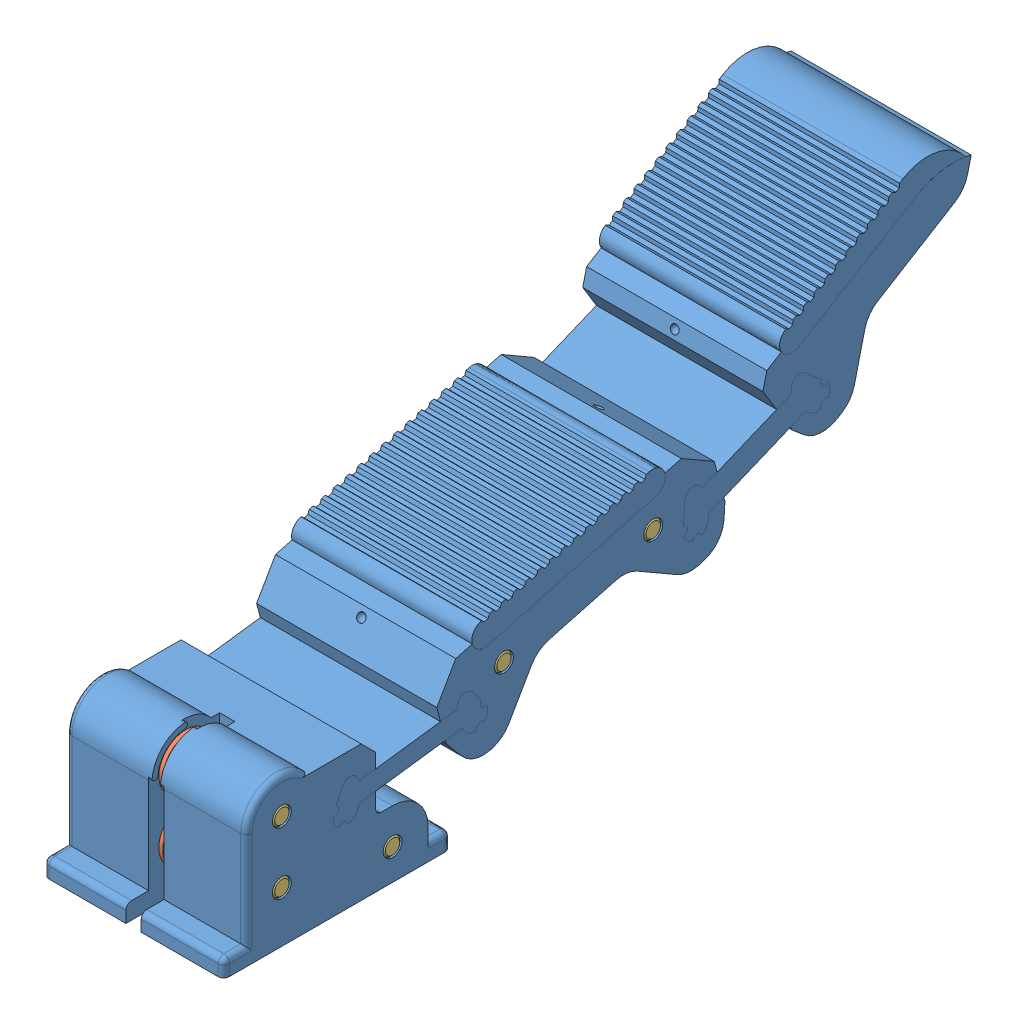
SolidWorks assembly Assem1.sldasm, configuration Default (file format 5000). Lengths in mm.
Overall size (31.97 64.26 131.69).
9 component instances, 3 part files, 16 mates.
Components (placement in the parent):
- finger_flexure-1: finger_flexure.SLDPRT [Default] at origin size (31.97 63.63 131.69)
- pulley-1: pulley.SLDPRT [Default] at (0.15 2.75 5.125) x (0 -1 0) z (0 0 1) size (9.5 2.4 9.5)
- pulley-2: pulley.SLDPRT [Default] at (0.15 -8.15 5.125) x (0 -1 0) z (0 0 1) size (9.5 2.4 9.5)
- pulley-3: pulley.SLDPRT [Default] at (-0.15 -11.6505 -14.375) x (0 -0.939835 -0.341628) z (0 -0.341628 0.939835) size (9.5 2.4 9.5)
- 98381A477-1: 98381A477.SLDPRT [98381A477] at (0 2.75 5.125) size (31.75 3.17 3.17)
- 98381A477-2: 98381A477.SLDPRT [98381A477] at (0 -8.15 5.125) size (31.75 3.17 3.17)
- 98381A477-3: 98381A477.SLDPRT [98381A477] at (0 -11.6505 -14.375) x (1 0 0) z (0 0.66308 0.748549) size (31.75 3.17 3.17)
- 98381A477-4: 98381A477.SLDPRT [98381A477] at (0 6.6803 -34.0028) x (1 0 0) z (0 -0.993949 -0.109841) size (31.75 3.17 3.17)
- 98381A477-5: 98381A477.SLDPRT [98381A477] at (0 13.7269 -60.3009) x (1 0 0) z (0 -0.752319 0.658799) size (31.75 3.17 3.17)
Mates (geometry in assembly coordinates):
- Concentric1: concentric aligned: cylinder of finger_flexure-1 through (-15.8753 2.75 5.125) axis (1 0 0) radius 1.6625; cylinder of 98381A477-1 through (-15.875 2.75 5.125) axis (1 0 0) radius 1.5875
- Coincident1: coincident aligned: plane of finger_flexure-1 through (15.875 9 11.375) normal (1 0 0); plane of 98381A477-1 through (15.875 2.75 5.125) normal (1 0 0)
- Concentric2: concentric: cylinder of finger_flexure-1 through (-15.8753 13.7269 -60.3009) axis (1 0 0) radius 1.6625; cylinder of 98381A477-5 through (-15.875 13.7269 -60.3009) axis (1 0 0) radius 1.5875
- Concentric3: concentric: cylinder of finger_flexure-1 through (-15.8753 6.6803 -34.0028) axis (1 0 0) radius 1.6625; cylinder of 98381A477-4 through (-15.875 6.6803 -34.0028) axis (1 0 0) radius 1.5875
- Concentric4: concentric aligned: cylinder of finger_flexure-1 through (-15.8753 -11.6505 -14.375) axis (1 0 0) radius 1.6625; cylinder of 98381A477-3 through (-15.875 -11.6505 -14.375) axis (1 0 0) radius 1.5875
- Concentric5: concentric aligned: cylinder of finger_flexure-1 through (-15.8753 -8.15 5.125) axis (1 0 0) radius 1.6625; cylinder of 98381A477-2 through (-15.875 -8.15 5.125) axis (1 0 0) radius 1.5875
- Coincident2: coincident aligned: plane of finger_flexure-1 through (15.875 9 11.375) normal (1 0 0); plane of 98381A477-2 through (15.875 -8.15 5.125) normal (1 0 0)
- Coincident3: coincident aligned: plane of finger_flexure-1 through (15.875 9 11.375) normal (1 0 0); plane of 98381A477-3 through (15.875 -11.6505 -14.375) normal (1 0 0)
- Coincident4: coincident aligned: plane of finger_flexure-1 through (15.875 9 11.375) normal (1 0 0); plane of 98381A477-4 through (15.875 6.6803 -34.0028) normal (1 0 0)
- Coincident5: coincident aligned: plane of finger_flexure-1 through (15.875 9 11.375) normal (1 0 0); plane of 98381A477-5 through (15.875 13.7269 -60.3009) normal (1 0 0)
- Concentric6: concentric anti-aligned: cylinder of pulley-1 through (0.15 2.75 5.125) axis (-1 0 0) radius 1.5; cylinder of 98381A477-1 through (-15.875 2.75 5.125) axis (1 0 0) radius 1.5875
- Concentric7: concentric anti-aligned: cylinder of pulley-2 through (0.15 -8.15 5.125) axis (-1 0 0) radius 1.5; cylinder of 98381A477-2 through (-15.875 -8.15 5.125) axis (1 0 0) radius 1.5875
- Concentric8: concentric anti-aligned: cylinder of pulley-3 through (-0.15 -11.6505 -14.375) axis (-1 0 0) radius 1.5; cylinder of 98381A477-3 through (-15.875 -11.6505 -14.375) axis (1 0 0) radius 1.5875
- Coincident6: coincident anti-aligned: plane of finger_flexure-1 through (-1.35 -11.6505 -14.375) normal (1 0 0); plane of pulley-3 through (-1.35 -13.0603 -14.8874) normal (-1 0 0)
- Coincident7: coincident anti-aligned: plane of finger_flexure-1 through (1.35 -11.6505 -14.375) normal (-1 0 0); plane of pulley-2 through (1.35 -9.65 5.125) normal (1 0 0)
- Coincident8: coincident anti-aligned: plane of finger_flexure-1 through (1.35 -11.6505 -14.375) normal (-1 0 0); plane of pulley-1 through (1.35 1.25 5.125) normal (1 0 0)
